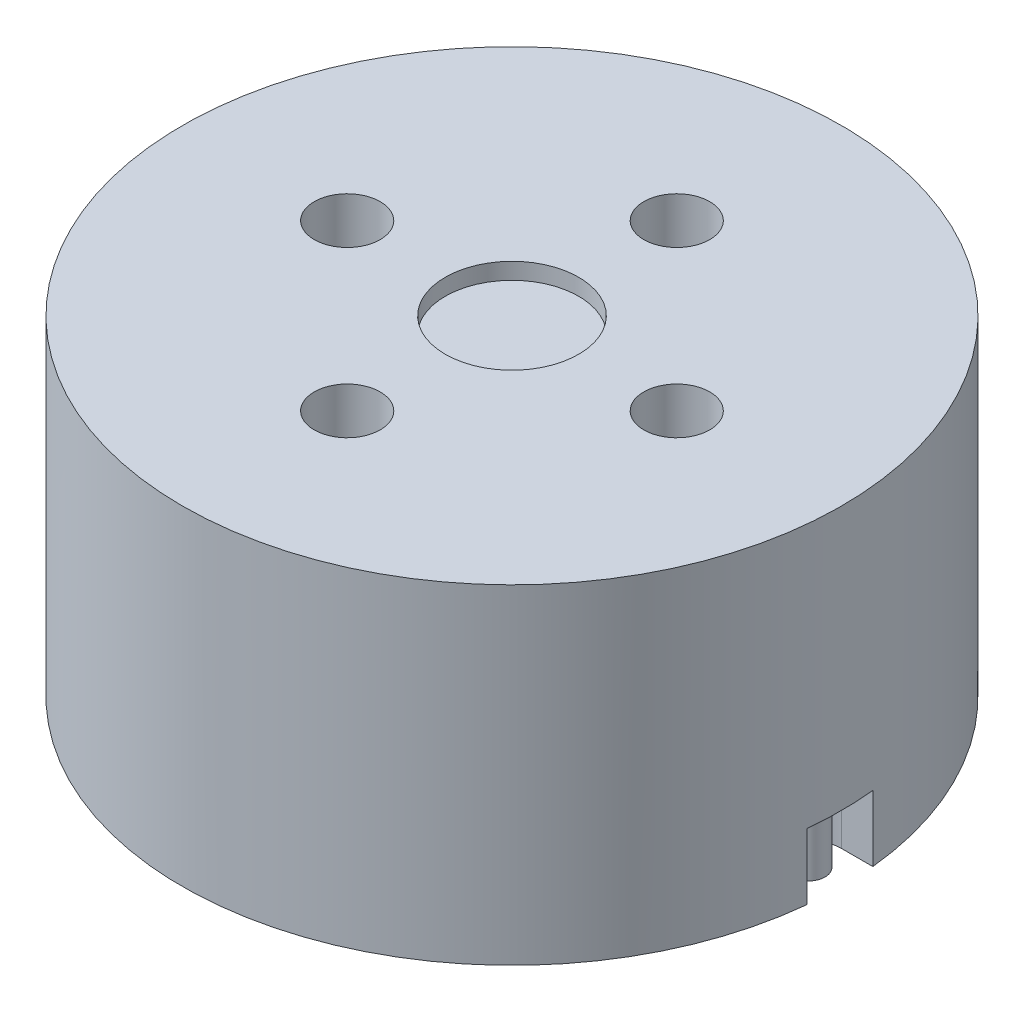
ISO-10303-21;
HEADER;
FILE_DESCRIPTION(('STEP AP214'),'2;1');
FILE_NAME('part.step','',(''),(''),'','','');
FILE_SCHEMA(('AUTOMOTIVE_DESIGN { 1 0 10303 214 1 1 1 1 }'));
ENDSEC;
DATA;
#1=APPLICATION_CONTEXT('core data for automotive mechanical design processes');
#2=APPLICATION_PROTOCOL_DEFINITION('international standard','automotive_design',2000,#1);
#3=PRODUCT_CONTEXT('',#1,'mechanical');
#4=PRODUCT('Part','Part','',(#3));
#5=PRODUCT_RELATED_PRODUCT_CATEGORY('part','',(#4));
#6=PRODUCT_DEFINITION_FORMATION('','',#4);
#7=PRODUCT_DEFINITION_CONTEXT('part definition',#1,'design');
#8=PRODUCT_DEFINITION('design','',#6,#7);
#9=PRODUCT_DEFINITION_SHAPE('','',#8);
#10=(LENGTH_UNIT() NAMED_UNIT(*) SI_UNIT(.MILLI.,.METRE.));
#11=(NAMED_UNIT(*) PLANE_ANGLE_UNIT() SI_UNIT($,.RADIAN.));
#12=(NAMED_UNIT(*) SI_UNIT($,.STERADIAN.) SOLID_ANGLE_UNIT());
#13=UNCERTAINTY_MEASURE_WITH_UNIT(LENGTH_MEASURE(1.E-05),#10,'distance_accuracy_value','');
#14=(GEOMETRIC_REPRESENTATION_CONTEXT(3) GLOBAL_UNCERTAINTY_ASSIGNED_CONTEXT((#13)) GLOBAL_UNIT_ASSIGNED_CONTEXT((#10,
#11,#12)) REPRESENTATION_CONTEXT('',''));
#15=CARTESIAN_POINT('',(0.,0.,0.));
#16=DIRECTION('',(0.,0.,1.));
#17=DIRECTION('',(1.,0.,0.));
#18=AXIS2_PLACEMENT_3D('',#15,#16,#17);
#19=CARTESIAN_POINT('',(0.,20.,0.));
#20=DIRECTION('',(0.,-1.,0.));
#21=DIRECTION('',(0.,0.,-1.));
#22=AXIS2_PLACEMENT_3D('',#19,#20,#21);
#23=CYLINDRICAL_SURFACE('',#22,20.);
#24=CARTESIAN_POINT('',(0.,0.,0.));
#25=DIRECTION('',(0.,1.,0.));
#26=DIRECTION('',(0.,0.,1.));
#27=AXIS2_PLACEMENT_3D('',#24,#25,#26);
#28=CIRCLE('',#27,20.);
#29=CARTESIAN_POINT('',(19.8997487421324,0.,-2.));
#30=VERTEX_POINT('',#29);
#31=CARTESIAN_POINT('',(-19.8997487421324,0.,-2.));
#32=VERTEX_POINT('',#31);
#33=EDGE_CURVE('E51',#30,#32,#28,.T.);
#34=ORIENTED_EDGE('',*,*,#33,.T.);
#35=DIRECTION('',(0.,-1.,0.));
#36=VECTOR('',#35,1.);
#37=CARTESIAN_POINT('',(-19.8997487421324,4.,-2.));
#38=LINE('',#37,#36);
#39=CARTESIAN_POINT('',(-19.8997487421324,4.,-2.));
#40=VERTEX_POINT('',#39);
#41=EDGE_CURVE('E144',#40,#32,#38,.T.);
#42=ORIENTED_EDGE('',*,*,#41,.F.);
#43=CARTESIAN_POINT('',(-3.15719672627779E-13,4.,0.));
#44=DIRECTION('',(0.,-1.,0.));
#45=DIRECTION('',(0.,0.,-1.));
#46=AXIS2_PLACEMENT_3D('',#43,#44,#45);
#47=CIRCLE('',#46,19.9999999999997);
#48=CARTESIAN_POINT('',(-19.8997487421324,4.,2.));
#49=VERTEX_POINT('',#48);
#50=EDGE_CURVE('E123',#49,#40,#47,.T.);
#51=ORIENTED_EDGE('',*,*,#50,.F.);
#52=DIRECTION('',(0.,-1.,0.));
#53=VECTOR('',#52,1.);
#54=CARTESIAN_POINT('',(-19.8997487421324,4.,2.));
#55=LINE('',#54,#53);
#56=CARTESIAN_POINT('',(-19.8997487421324,0.,2.));
#57=VERTEX_POINT('',#56);
#58=EDGE_CURVE('E114',#49,#57,#55,.T.);
#59=ORIENTED_EDGE('',*,*,#58,.T.);
#60=CARTESIAN_POINT('',(19.8997487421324,0.,2.));
#61=VERTEX_POINT('',#60);
#62=EDGE_CURVE('E46',#57,#61,#28,.T.);
#63=ORIENTED_EDGE('',*,*,#62,.T.);
#64=DIRECTION('',(0.,-1.,0.));
#65=VECTOR('',#64,1.);
#66=CARTESIAN_POINT('',(19.8997487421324,4.,2.));
#67=LINE('',#66,#65);
#68=CARTESIAN_POINT('',(19.8997487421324,4.,2.));
#69=VERTEX_POINT('',#68);
#70=EDGE_CURVE('E153',#69,#61,#67,.T.);
#71=ORIENTED_EDGE('',*,*,#70,.F.);
#72=CARTESIAN_POINT('',(-3.15719672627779E-13,4.,0.));
#73=DIRECTION('',(0.,-1.,0.));
#74=DIRECTION('',(0.,0.,1.));
#75=AXIS2_PLACEMENT_3D('',#72,#73,#74);
#76=CIRCLE('',#75,20.0000000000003);
#77=CARTESIAN_POINT('',(19.8997487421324,4.,-2.));
#78=VERTEX_POINT('',#77);
#79=EDGE_CURVE('E168',#78,#69,#76,.T.);
#80=ORIENTED_EDGE('',*,*,#79,.F.);
#81=DIRECTION('',(0.,-1.,0.));
#82=VECTOR('',#81,1.);
#83=CARTESIAN_POINT('',(19.8997487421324,4.,-2.));
#84=LINE('',#83,#82);
#85=EDGE_CURVE('E150',#78,#30,#84,.T.);
#86=ORIENTED_EDGE('',*,*,#85,.T.);
#87=EDGE_LOOP('',(#34,#42,#51,#59,#63,#71,#80,#86));
#88=FACE_BOUND('',#87,.T.);
#89=CARTESIAN_POINT('',(0.,20.,0.));
#90=DIRECTION('',(0.,1.,0.));
#91=DIRECTION('',(0.,0.,1.));
#92=AXIS2_PLACEMENT_3D('',#89,#90,#91);
#93=CIRCLE('',#92,20.);
#94=CARTESIAN_POINT('',(0.,20.,20.));
#95=VERTEX_POINT('',#94);
#96=EDGE_CURVE('E11',#95,#95,#93,.T.);
#97=ORIENTED_EDGE('',*,*,#96,.F.);
#98=EDGE_LOOP('',(#97));
#99=FACE_BOUND('',#98,.T.);
#100=ADVANCED_FACE('F43',(#88,#99),#23,.T.);
#101=CARTESIAN_POINT('',(0.,20.,0.));
#102=DIRECTION('',(0.,1.,0.));
#103=DIRECTION('',(0.,0.,1.));
#104=AXIS2_PLACEMENT_3D('',#101,#102,#103);
#105=PLANE('',#104);
#106=CARTESIAN_POINT('',(0.,20.,0.));
#107=DIRECTION('',(0.,1.,0.));
#108=DIRECTION('',(0.,0.,1.));
#109=AXIS2_PLACEMENT_3D('',#106,#107,#108);
#110=CIRCLE('',#109,4.05);
#111=CARTESIAN_POINT('',(0.,20.,4.05));
#112=VERTEX_POINT('',#111);
#113=EDGE_CURVE('E182',#112,#112,#110,.T.);
#114=ORIENTED_EDGE('',*,*,#113,.F.);
#115=EDGE_LOOP('',(#114));
#116=FACE_BOUND('',#115,.T.);
#117=CARTESIAN_POINT('',(0.,20.,-10.));
#118=DIRECTION('',(0.,1.,0.));
#119=DIRECTION('',(0.,0.,1.));
#120=AXIS2_PLACEMENT_3D('',#117,#118,#119);
#121=CIRCLE('',#120,2.);
#122=CARTESIAN_POINT('',(0.,20.,-8.));
#123=VERTEX_POINT('',#122);
#124=EDGE_CURVE('E192',#123,#123,#121,.T.);
#125=ORIENTED_EDGE('',*,*,#124,.F.);
#126=EDGE_LOOP('',(#125));
#127=FACE_BOUND('',#126,.T.);
#128=CARTESIAN_POINT('',(10.,20.,0.));
#129=DIRECTION('',(0.,1.,0.));
#130=DIRECTION('',(0.,0.,1.));
#131=AXIS2_PLACEMENT_3D('',#128,#129,#130);
#132=CIRCLE('',#131,2.);
#133=CARTESIAN_POINT('',(10.,20.,2.00000000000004));
#134=VERTEX_POINT('',#133);
#135=EDGE_CURVE('E195',#134,#134,#132,.T.);
#136=ORIENTED_EDGE('',*,*,#135,.F.);
#137=EDGE_LOOP('',(#136));
#138=FACE_BOUND('',#137,.T.);
#139=CARTESIAN_POINT('',(0.,20.,10.));
#140=DIRECTION('',(0.,1.,0.));
#141=DIRECTION('',(0.,0.,1.));
#142=AXIS2_PLACEMENT_3D('',#139,#140,#141);
#143=CIRCLE('',#142,2.);
#144=CARTESIAN_POINT('',(0.,20.,12.));
#145=VERTEX_POINT('',#144);
#146=EDGE_CURVE('E201',#145,#145,#143,.T.);
#147=ORIENTED_EDGE('',*,*,#146,.F.);
#148=EDGE_LOOP('',(#147));
#149=FACE_BOUND('',#148,.T.);
#150=CARTESIAN_POINT('',(-10.,20.,-1.04744440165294E-13));
#151=DIRECTION('',(0.,1.,0.));
#152=DIRECTION('',(0.,0.,1.));
#153=AXIS2_PLACEMENT_3D('',#150,#151,#152);
#154=CIRCLE('',#153,2.);
#155=CARTESIAN_POINT('',(-10.,20.,1.99999999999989));
#156=VERTEX_POINT('',#155);
#157=EDGE_CURVE('E207',#156,#156,#154,.T.);
#158=ORIENTED_EDGE('',*,*,#157,.F.);
#159=EDGE_LOOP('',(#158));
#160=FACE_BOUND('',#159,.T.);
#161=ORIENTED_EDGE('',*,*,#96,.T.);
#162=EDGE_LOOP('',(#161));
#163=FACE_BOUND('',#162,.T.);
#164=ADVANCED_FACE('F223',(#116,#127,#138,#149,#160,#163),#105,.T.);
#165=CARTESIAN_POINT('',(0.,0.,0.));
#166=DIRECTION('',(0.,1.,0.));
#167=DIRECTION('',(0.,0.,1.));
#168=AXIS2_PLACEMENT_3D('',#165,#166,#167);
#169=PLANE('',#168);
#170=CARTESIAN_POINT('',(0.,0.,0.));
#171=DIRECTION('',(0.,-1.,0.));
#172=DIRECTION('',(0.,0.,-1.));
#173=AXIS2_PLACEMENT_3D('',#170,#171,#172);
#174=CIRCLE('',#173,1.);
#175=CARTESIAN_POINT('',(0.,0.,-1.));
#176=VERTEX_POINT('',#175);
#177=EDGE_CURVE('E143',#176,#176,#174,.T.);
#178=ORIENTED_EDGE('',*,*,#177,.F.);
#179=EDGE_LOOP('',(#178));
#180=FACE_BOUND('',#179,.T.);
#181=CARTESIAN_POINT('',(0.,0.,-10.));
#182=DIRECTION('',(0.,1.,0.));
#183=DIRECTION('',(0.,0.,1.));
#184=AXIS2_PLACEMENT_3D('',#181,#182,#183);
#185=CIRCLE('',#184,2.);
#186=CARTESIAN_POINT('',(0.,0.,-8.));
#187=VERTEX_POINT('',#186);
#188=EDGE_CURVE('E189',#187,#187,#185,.T.);
#189=ORIENTED_EDGE('',*,*,#188,.T.);
#190=EDGE_LOOP('',(#189));
#191=FACE_BOUND('',#190,.T.);
#192=CARTESIAN_POINT('',(10.,0.,0.));
#193=DIRECTION('',(0.,1.,0.));
#194=DIRECTION('',(0.,0.,1.));
#195=AXIS2_PLACEMENT_3D('',#192,#193,#194);
#196=CIRCLE('',#195,2.);
#197=CARTESIAN_POINT('',(10.,0.,2.00000000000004));
#198=VERTEX_POINT('',#197);
#199=EDGE_CURVE('E198',#198,#198,#196,.T.);
#200=ORIENTED_EDGE('',*,*,#199,.T.);
#201=EDGE_LOOP('',(#200));
#202=FACE_BOUND('',#201,.T.);
#203=CARTESIAN_POINT('',(0.,0.,10.));
#204=DIRECTION('',(0.,1.,0.));
#205=DIRECTION('',(0.,0.,1.));
#206=AXIS2_PLACEMENT_3D('',#203,#204,#205);
#207=CIRCLE('',#206,2.);
#208=CARTESIAN_POINT('',(0.,0.,12.));
#209=VERTEX_POINT('',#208);
#210=EDGE_CURVE('E204',#209,#209,#207,.T.);
#211=ORIENTED_EDGE('',*,*,#210,.T.);
#212=EDGE_LOOP('',(#211));
#213=FACE_BOUND('',#212,.T.);
#214=CARTESIAN_POINT('',(-10.,0.,-1.04744440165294E-13));
#215=DIRECTION('',(0.,1.,0.));
#216=DIRECTION('',(0.,0.,1.));
#217=AXIS2_PLACEMENT_3D('',#214,#215,#216);
#218=CIRCLE('',#217,2.);
#219=CARTESIAN_POINT('',(-10.,0.,1.99999999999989));
#220=VERTEX_POINT('',#219);
#221=EDGE_CURVE('E186',#220,#220,#218,.T.);
#222=ORIENTED_EDGE('',*,*,#221,.T.);
#223=EDGE_LOOP('',(#222));
#224=FACE_BOUND('',#223,.T.);
#225=CARTESIAN_POINT('',(-18.,0.,0.));
#226=DIRECTION('',(0.,-1.,0.));
#227=DIRECTION('',(0.,0.,-1.));
#228=AXIS2_PLACEMENT_3D('',#225,#226,#227);
#229=CIRCLE('',#228,2.);
#230=CARTESIAN_POINT('',(-18.,0.,-2.));
#231=VERTEX_POINT('',#230);
#232=CARTESIAN_POINT('',(-18.,0.,2.));
#233=VERTEX_POINT('',#232);
#234=EDGE_CURVE('E58',#231,#233,#229,.T.);
#235=ORIENTED_EDGE('',*,*,#234,.F.);
#236=DIRECTION('',(1.,0.,0.));
#237=VECTOR('',#236,1.);
#238=CARTESIAN_POINT('',(-18.,0.,-2.));
#239=LINE('',#238,#237);
#240=EDGE_CURVE('E127',#32,#231,#239,.T.);
#241=ORIENTED_EDGE('',*,*,#240,.F.);
#242=ORIENTED_EDGE('',*,*,#33,.F.);
#243=DIRECTION('',(1.,0.,0.));
#244=VECTOR('',#243,1.);
#245=CARTESIAN_POINT('',(18.,0.,-2.));
#246=LINE('',#245,#244);
#247=CARTESIAN_POINT('',(18.,0.,-2.));
#248=VERTEX_POINT('',#247);
#249=EDGE_CURVE('E161',#248,#30,#246,.T.);
#250=ORIENTED_EDGE('',*,*,#249,.F.);
#251=CARTESIAN_POINT('',(18.,0.,0.));
#252=DIRECTION('',(0.,-1.,0.));
#253=DIRECTION('',(0.,0.,1.));
#254=AXIS2_PLACEMENT_3D('',#251,#252,#253);
#255=CIRCLE('',#254,2.);
#256=CARTESIAN_POINT('',(18.,0.,2.));
#257=VERTEX_POINT('',#256);
#258=EDGE_CURVE('E66',#257,#248,#255,.T.);
#259=ORIENTED_EDGE('',*,*,#258,.F.);
#260=DIRECTION('',(-1.,0.,0.));
#261=VECTOR('',#260,1.);
#262=CARTESIAN_POINT('',(18.,0.,2.));
#263=LINE('',#262,#261);
#264=EDGE_CURVE('E158',#61,#257,#263,.T.);
#265=ORIENTED_EDGE('',*,*,#264,.F.);
#266=ORIENTED_EDGE('',*,*,#62,.F.);
#267=DIRECTION('',(-1.,0.,0.));
#268=VECTOR('',#267,1.);
#269=CARTESIAN_POINT('',(-18.,0.,2.));
#270=LINE('',#269,#268);
#271=EDGE_CURVE('E130',#233,#57,#270,.T.);
#272=ORIENTED_EDGE('',*,*,#271,.F.);
#273=EDGE_LOOP('',(#235,#241,#242,#250,#259,#265,#266,#272));
#274=FACE_BOUND('',#273,.T.);
#275=ADVANCED_FACE('F213',(#180,#191,#202,#213,#224,#274),#169,.F.);
#276=CARTESIAN_POINT('',(-10.,0.,-1.04744440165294E-13));
#277=DIRECTION('',(0.,1.,0.));
#278=DIRECTION('',(0.,0.,1.));
#279=AXIS2_PLACEMENT_3D('',#276,#277,#278);
#280=CYLINDRICAL_SURFACE('',#279,2.);
#281=ORIENTED_EDGE('',*,*,#221,.F.);
#282=EDGE_LOOP('',(#281));
#283=FACE_BOUND('',#282,.T.);
#284=ORIENTED_EDGE('',*,*,#157,.T.);
#285=EDGE_LOOP('',(#284));
#286=FACE_BOUND('',#285,.T.);
#287=ADVANCED_FACE('F216',(#283,#286),#280,.F.);
#288=CARTESIAN_POINT('',(0.,0.,10.));
#289=DIRECTION('',(0.,1.,0.));
#290=DIRECTION('',(0.,0.,1.));
#291=AXIS2_PLACEMENT_3D('',#288,#289,#290);
#292=CYLINDRICAL_SURFACE('',#291,2.);
#293=ORIENTED_EDGE('',*,*,#210,.F.);
#294=EDGE_LOOP('',(#293));
#295=FACE_BOUND('',#294,.T.);
#296=ORIENTED_EDGE('',*,*,#146,.T.);
#297=EDGE_LOOP('',(#296));
#298=FACE_BOUND('',#297,.T.);
#299=ADVANCED_FACE('F219',(#295,#298),#292,.F.);
#300=CARTESIAN_POINT('',(10.,0.,0.));
#301=DIRECTION('',(0.,1.,0.));
#302=DIRECTION('',(0.,0.,1.));
#303=AXIS2_PLACEMENT_3D('',#300,#301,#302);
#304=CYLINDRICAL_SURFACE('',#303,2.);
#305=ORIENTED_EDGE('',*,*,#199,.F.);
#306=EDGE_LOOP('',(#305));
#307=FACE_BOUND('',#306,.T.);
#308=ORIENTED_EDGE('',*,*,#135,.T.);
#309=EDGE_LOOP('',(#308));
#310=FACE_BOUND('',#309,.T.);
#311=ADVANCED_FACE('F284',(#307,#310),#304,.F.);
#312=CARTESIAN_POINT('',(0.,0.,-10.));
#313=DIRECTION('',(0.,1.,0.));
#314=DIRECTION('',(0.,0.,1.));
#315=AXIS2_PLACEMENT_3D('',#312,#313,#314);
#316=CYLINDRICAL_SURFACE('',#315,2.);
#317=ORIENTED_EDGE('',*,*,#188,.F.);
#318=EDGE_LOOP('',(#317));
#319=FACE_BOUND('',#318,.T.);
#320=ORIENTED_EDGE('',*,*,#124,.T.);
#321=EDGE_LOOP('',(#320));
#322=FACE_BOUND('',#321,.T.);
#323=ADVANCED_FACE('F280',(#319,#322),#316,.F.);
#324=CARTESIAN_POINT('',(0.,19.,0.));
#325=DIRECTION('',(0.,1.,0.));
#326=DIRECTION('',(0.,0.,1.));
#327=AXIS2_PLACEMENT_3D('',#324,#325,#326);
#328=CYLINDRICAL_SURFACE('',#327,4.05);
#329=CARTESIAN_POINT('',(0.,19.,0.));
#330=DIRECTION('',(0.,1.,0.));
#331=DIRECTION('',(0.,0.,1.));
#332=AXIS2_PLACEMENT_3D('',#329,#330,#331);
#333=CIRCLE('',#332,4.05);
#334=CARTESIAN_POINT('',(0.,19.,4.05));
#335=VERTEX_POINT('',#334);
#336=EDGE_CURVE('E183',#335,#335,#333,.T.);
#337=ORIENTED_EDGE('',*,*,#336,.F.);
#338=EDGE_LOOP('',(#337));
#339=FACE_BOUND('',#338,.T.);
#340=ORIENTED_EDGE('',*,*,#113,.T.);
#341=EDGE_LOOP('',(#340));
#342=FACE_BOUND('',#341,.T.);
#343=ADVANCED_FACE('F263',(#339,#342),#328,.F.);
#344=CARTESIAN_POINT('',(0.,19.,0.));
#345=DIRECTION('',(0.,1.,0.));
#346=DIRECTION('',(0.,0.,1.));
#347=AXIS2_PLACEMENT_3D('',#344,#345,#346);
#348=PLANE('',#347);
#349=ORIENTED_EDGE('',*,*,#336,.T.);
#350=EDGE_LOOP('',(#349));
#351=FACE_BOUND('',#350,.T.);
#352=ADVANCED_FACE('F257',(#351),#348,.T.);
#353=CARTESIAN_POINT('',(18.,4.,0.));
#354=DIRECTION('',(0.,-1.,0.));
#355=DIRECTION('',(0.,0.,-1.));
#356=AXIS2_PLACEMENT_3D('',#353,#354,#355);
#357=CYLINDRICAL_SURFACE('',#356,2.);
#358=ORIENTED_EDGE('',*,*,#258,.T.);
#359=DIRECTION('',(0.,-1.,0.));
#360=VECTOR('',#359,1.);
#361=CARTESIAN_POINT('',(18.,4.,-2.));
#362=LINE('',#361,#360);
#363=CARTESIAN_POINT('',(18.,4.,-2.));
#364=VERTEX_POINT('',#363);
#365=EDGE_CURVE('E147',#364,#248,#362,.T.);
#366=ORIENTED_EDGE('',*,*,#365,.F.);
#367=CARTESIAN_POINT('',(18.,4.,0.));
#368=DIRECTION('',(0.,-1.,0.));
#369=DIRECTION('',(0.,0.,1.));
#370=AXIS2_PLACEMENT_3D('',#367,#368,#369);
#371=CIRCLE('',#370,2.);
#372=CARTESIAN_POINT('',(18.,4.,2.));
#373=VERTEX_POINT('',#372);
#374=EDGE_CURVE('E162',#373,#364,#371,.T.);
#375=ORIENTED_EDGE('',*,*,#374,.F.);
#376=DIRECTION('',(0.,-1.,0.));
#377=VECTOR('',#376,1.);
#378=CARTESIAN_POINT('',(18.,4.,2.));
#379=LINE('',#378,#377);
#380=EDGE_CURVE('E155',#373,#257,#379,.T.);
#381=ORIENTED_EDGE('',*,*,#380,.T.);
#382=EDGE_LOOP('',(#358,#366,#375,#381));
#383=FACE_BOUND('',#382,.T.);
#384=ADVANCED_FACE('F255',(#383),#357,.F.);
#385=CARTESIAN_POINT('',(18.,4.,2.));
#386=DIRECTION('',(0.,0.,1.));
#387=DIRECTION('',(1.,0.,0.));
#388=AXIS2_PLACEMENT_3D('',#385,#386,#387);
#389=PLANE('',#388);
#390=ORIENTED_EDGE('',*,*,#264,.T.);
#391=ORIENTED_EDGE('',*,*,#380,.F.);
#392=DIRECTION('',(-1.,0.,0.));
#393=VECTOR('',#392,1.);
#394=CARTESIAN_POINT('',(18.,4.,2.));
#395=LINE('',#394,#393);
#396=EDGE_CURVE('E149',#69,#373,#395,.T.);
#397=ORIENTED_EDGE('',*,*,#396,.F.);
#398=ORIENTED_EDGE('',*,*,#70,.T.);
#399=EDGE_LOOP('',(#390,#391,#397,#398));
#400=FACE_BOUND('',#399,.T.);
#401=ADVANCED_FACE('F247',(#400),#389,.F.);
#402=CARTESIAN_POINT('',(18.,4.,-2.));
#403=DIRECTION('',(0.,0.,-1.));
#404=DIRECTION('',(-1.,0.,0.));
#405=AXIS2_PLACEMENT_3D('',#402,#403,#404);
#406=PLANE('',#405);
#407=ORIENTED_EDGE('',*,*,#249,.T.);
#408=ORIENTED_EDGE('',*,*,#85,.F.);
#409=DIRECTION('',(1.,0.,0.));
#410=VECTOR('',#409,1.);
#411=CARTESIAN_POINT('',(18.,4.,-2.));
#412=LINE('',#411,#410);
#413=EDGE_CURVE('E170',#364,#78,#412,.T.);
#414=ORIENTED_EDGE('',*,*,#413,.F.);
#415=ORIENTED_EDGE('',*,*,#365,.T.);
#416=EDGE_LOOP('',(#407,#408,#414,#415));
#417=FACE_BOUND('',#416,.T.);
#418=ADVANCED_FACE('F254',(#417),#406,.F.);
#419=CARTESIAN_POINT('',(18.,4.,0.));
#420=DIRECTION('',(0.,1.,0.));
#421=DIRECTION('',(0.,0.,1.));
#422=AXIS2_PLACEMENT_3D('',#419,#420,#421);
#423=PLANE('',#422);
#424=CARTESIAN_POINT('',(18.,4.,0.));
#425=DIRECTION('',(0.,-1.,0.));
#426=DIRECTION('',(0.,0.,1.));
#427=AXIS2_PLACEMENT_3D('',#424,#425,#426);
#428=CIRCLE('',#427,0.999999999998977);
#429=CARTESIAN_POINT('',(18.,4.,0.999999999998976));
#430=VERTEX_POINT('',#429);
#431=EDGE_CURVE('E165',#430,#430,#428,.T.);
#432=ORIENTED_EDGE('',*,*,#431,.F.);
#433=EDGE_LOOP('',(#432));
#434=FACE_BOUND('',#433,.T.);
#435=ORIENTED_EDGE('',*,*,#374,.T.);
#436=ORIENTED_EDGE('',*,*,#413,.T.);
#437=ORIENTED_EDGE('',*,*,#79,.T.);
#438=ORIENTED_EDGE('',*,*,#396,.T.);
#439=EDGE_LOOP('',(#435,#436,#437,#438));
#440=FACE_BOUND('',#439,.T.);
#441=ADVANCED_FACE('F251',(#434,#440),#423,.F.);
#442=CARTESIAN_POINT('',(18.,4.,0.));
#443=DIRECTION('',(0.,-1.,0.));
#444=DIRECTION('',(0.,0.,-1.));
#445=AXIS2_PLACEMENT_3D('',#442,#443,#444);
#446=CYLINDRICAL_SURFACE('',#445,0.999999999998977);
#447=ORIENTED_EDGE('',*,*,#431,.T.);
#448=EDGE_LOOP('',(#447));
#449=FACE_BOUND('',#448,.T.);
#450=CARTESIAN_POINT('',(18.,0.,0.));
#451=DIRECTION('',(0.,-1.,0.));
#452=DIRECTION('',(0.,0.,1.));
#453=AXIS2_PLACEMENT_3D('',#450,#451,#452);
#454=CIRCLE('',#453,0.999999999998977);
#455=CARTESIAN_POINT('',(18.,0.,0.999999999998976));
#456=VERTEX_POINT('',#455);
#457=EDGE_CURVE('E175',#456,#456,#454,.T.);
#458=ORIENTED_EDGE('',*,*,#457,.F.);
#459=EDGE_LOOP('',(#458));
#460=FACE_BOUND('',#459,.T.);
#461=ADVANCED_FACE('F273',(#449,#460),#446,.T.);
#462=CARTESIAN_POINT('',(-18.,4.,0.));
#463=DIRECTION('',(0.,-1.,0.));
#464=DIRECTION('',(0.,0.,-1.));
#465=AXIS2_PLACEMENT_3D('',#462,#463,#464);
#466=CYLINDRICAL_SURFACE('',#465,2.);
#467=ORIENTED_EDGE('',*,*,#234,.T.);
#468=DIRECTION('',(0.,-1.,0.));
#469=VECTOR('',#468,1.);
#470=CARTESIAN_POINT('',(-18.,4.,2.));
#471=LINE('',#470,#469);
#472=CARTESIAN_POINT('',(-18.,4.,2.));
#473=VERTEX_POINT('',#472);
#474=EDGE_CURVE('E106',#473,#233,#471,.T.);
#475=ORIENTED_EDGE('',*,*,#474,.F.);
#476=CARTESIAN_POINT('',(-18.,4.,0.));
#477=DIRECTION('',(0.,-1.,0.));
#478=DIRECTION('',(0.,0.,-1.));
#479=AXIS2_PLACEMENT_3D('',#476,#477,#478);
#480=CIRCLE('',#479,2.);
#481=CARTESIAN_POINT('',(-18.,4.,-2.));
#482=VERTEX_POINT('',#481);
#483=EDGE_CURVE('E110',#482,#473,#480,.T.);
#484=ORIENTED_EDGE('',*,*,#483,.F.);
#485=DIRECTION('',(0.,-1.,0.));
#486=VECTOR('',#485,1.);
#487=CARTESIAN_POINT('',(-18.,4.,-2.));
#488=LINE('',#487,#486);
#489=EDGE_CURVE('E141',#482,#231,#488,.T.);
#490=ORIENTED_EDGE('',*,*,#489,.T.);
#491=EDGE_LOOP('',(#467,#475,#484,#490));
#492=FACE_BOUND('',#491,.T.);
#493=ADVANCED_FACE('F108',(#492),#466,.F.);
#494=CARTESIAN_POINT('',(-18.,4.,-2.));
#495=DIRECTION('',(0.,0.,-1.));
#496=DIRECTION('',(-1.,0.,0.));
#497=AXIS2_PLACEMENT_3D('',#494,#495,#496);
#498=PLANE('',#497);
#499=ORIENTED_EDGE('',*,*,#240,.T.);
#500=ORIENTED_EDGE('',*,*,#489,.F.);
#501=DIRECTION('',(1.,0.,0.));
#502=VECTOR('',#501,1.);
#503=CARTESIAN_POINT('',(-18.,4.,-2.));
#504=LINE('',#503,#502);
#505=EDGE_CURVE('E115',#40,#482,#504,.T.);
#506=ORIENTED_EDGE('',*,*,#505,.F.);
#507=ORIENTED_EDGE('',*,*,#41,.T.);
#508=EDGE_LOOP('',(#499,#500,#506,#507));
#509=FACE_BOUND('',#508,.T.);
#510=ADVANCED_FACE('F321',(#509),#498,.F.);
#511=CARTESIAN_POINT('',(-18.,4.,2.));
#512=DIRECTION('',(0.,0.,1.));
#513=DIRECTION('',(1.,0.,0.));
#514=AXIS2_PLACEMENT_3D('',#511,#512,#513);
#515=PLANE('',#514);
#516=ORIENTED_EDGE('',*,*,#271,.T.);
#517=ORIENTED_EDGE('',*,*,#58,.F.);
#518=DIRECTION('',(-1.,0.,0.));
#519=VECTOR('',#518,1.);
#520=CARTESIAN_POINT('',(-18.,4.,2.));
#521=LINE('',#520,#519);
#522=EDGE_CURVE('E118',#473,#49,#521,.T.);
#523=ORIENTED_EDGE('',*,*,#522,.F.);
#524=ORIENTED_EDGE('',*,*,#474,.T.);
#525=EDGE_LOOP('',(#516,#517,#523,#524));
#526=FACE_BOUND('',#525,.T.);
#527=ADVANCED_FACE('F119',(#526),#515,.F.);
#528=CARTESIAN_POINT('',(-18.,4.,0.));
#529=DIRECTION('',(0.,-1.,0.));
#530=DIRECTION('',(0.,0.,-1.));
#531=AXIS2_PLACEMENT_3D('',#528,#529,#530);
#532=PLANE('',#531);
#533=CARTESIAN_POINT('',(-18.,4.,0.));
#534=DIRECTION('',(0.,-1.,0.));
#535=DIRECTION('',(0.,0.,-1.));
#536=AXIS2_PLACEMENT_3D('',#533,#534,#535);
#537=CIRCLE('',#536,1.);
#538=CARTESIAN_POINT('',(-18.,4.,-1.));
#539=VERTEX_POINT('',#538);
#540=EDGE_CURVE('E139',#539,#539,#537,.T.);
#541=ORIENTED_EDGE('',*,*,#540,.F.);
#542=EDGE_LOOP('',(#541));
#543=FACE_BOUND('',#542,.T.);
#544=ORIENTED_EDGE('',*,*,#483,.T.);
#545=ORIENTED_EDGE('',*,*,#522,.T.);
#546=ORIENTED_EDGE('',*,*,#50,.T.);
#547=ORIENTED_EDGE('',*,*,#505,.T.);
#548=EDGE_LOOP('',(#544,#545,#546,#547));
#549=FACE_BOUND('',#548,.T.);
#550=ADVANCED_FACE('F125',(#543,#549),#532,.T.);
#551=CARTESIAN_POINT('',(-18.,4.,0.));
#552=DIRECTION('',(0.,-1.,0.));
#553=DIRECTION('',(0.,0.,-1.));
#554=AXIS2_PLACEMENT_3D('',#551,#552,#553);
#555=CYLINDRICAL_SURFACE('',#554,1.);
#556=ORIENTED_EDGE('',*,*,#540,.T.);
#557=EDGE_LOOP('',(#556));
#558=FACE_BOUND('',#557,.T.);
#559=CARTESIAN_POINT('',(-18.,0.,0.));
#560=DIRECTION('',(0.,-1.,0.));
#561=DIRECTION('',(0.,0.,-1.));
#562=AXIS2_PLACEMENT_3D('',#559,#560,#561);
#563=CIRCLE('',#562,1.);
#564=CARTESIAN_POINT('',(-18.,0.,-1.));
#565=VERTEX_POINT('',#564);
#566=EDGE_CURVE('E133',#565,#565,#563,.T.);
#567=ORIENTED_EDGE('',*,*,#566,.F.);
#568=EDGE_LOOP('',(#567));
#569=FACE_BOUND('',#568,.T.);
#570=ADVANCED_FACE('F302',(#558,#569),#555,.T.);
#571=ORIENTED_EDGE('',*,*,#457,.T.);
#572=EDGE_LOOP('',(#571));
#573=FACE_BOUND('',#572,.T.);
#574=ADVANCED_FACE('F293',(#573),#169,.F.);
#575=ORIENTED_EDGE('',*,*,#566,.T.);
#576=EDGE_LOOP('',(#575));
#577=FACE_BOUND('',#576,.T.);
#578=ADVANCED_FACE('F292',(#577),#169,.F.);
#579=CARTESIAN_POINT('',(0.,-11.,0.));
#580=DIRECTION('',(0.,1.,0.));
#581=DIRECTION('',(0.,0.,1.));
#582=AXIS2_PLACEMENT_3D('',#579,#580,#581);
#583=CYLINDRICAL_SURFACE('',#582,1.);
#584=CARTESIAN_POINT('',(0.,-11.,0.));
#585=DIRECTION('',(0.,-1.,0.));
#586=DIRECTION('',(0.,0.,-1.));
#587=AXIS2_PLACEMENT_3D('',#584,#585,#586);
#588=CIRCLE('',#587,1.);
#589=CARTESIAN_POINT('',(0.,-11.,-1.));
#590=VERTEX_POINT('',#589);
#591=EDGE_CURVE('E157',#590,#590,#588,.T.);
#592=ORIENTED_EDGE('',*,*,#591,.F.);
#593=EDGE_LOOP('',(#592));
#594=FACE_BOUND('',#593,.T.);
#595=ORIENTED_EDGE('',*,*,#177,.T.);
#596=EDGE_LOOP('',(#595));
#597=FACE_BOUND('',#596,.T.);
#598=ADVANCED_FACE('F299',(#594,#597),#583,.T.);
#599=CARTESIAN_POINT('',(0.,-11.,0.));
#600=DIRECTION('',(0.,-1.,0.));
#601=DIRECTION('',(0.,0.,-1.));
#602=AXIS2_PLACEMENT_3D('',#599,#600,#601);
#603=PLANE('',#602);
#604=ORIENTED_EDGE('',*,*,#591,.T.);
#605=EDGE_LOOP('',(#604));
#606=FACE_BOUND('',#605,.T.);
#607=ADVANCED_FACE('F351',(#606),#603,.T.);
#608=CLOSED_SHELL('',(#100,#164,#275,#287,#299,#311,#323,#343,#352,#384,#401,#418,#441,#461,
#493,#510,#527,#550,#570,#574,#578,#598,#607));
#609=MANIFOLD_SOLID_BREP('B2',#608);
#610=ADVANCED_BREP_SHAPE_REPRESENTATION('',(#18,#609),#14);
#611=SHAPE_DEFINITION_REPRESENTATION(#9,#610);
ENDSEC;
END-ISO-10303-21;
